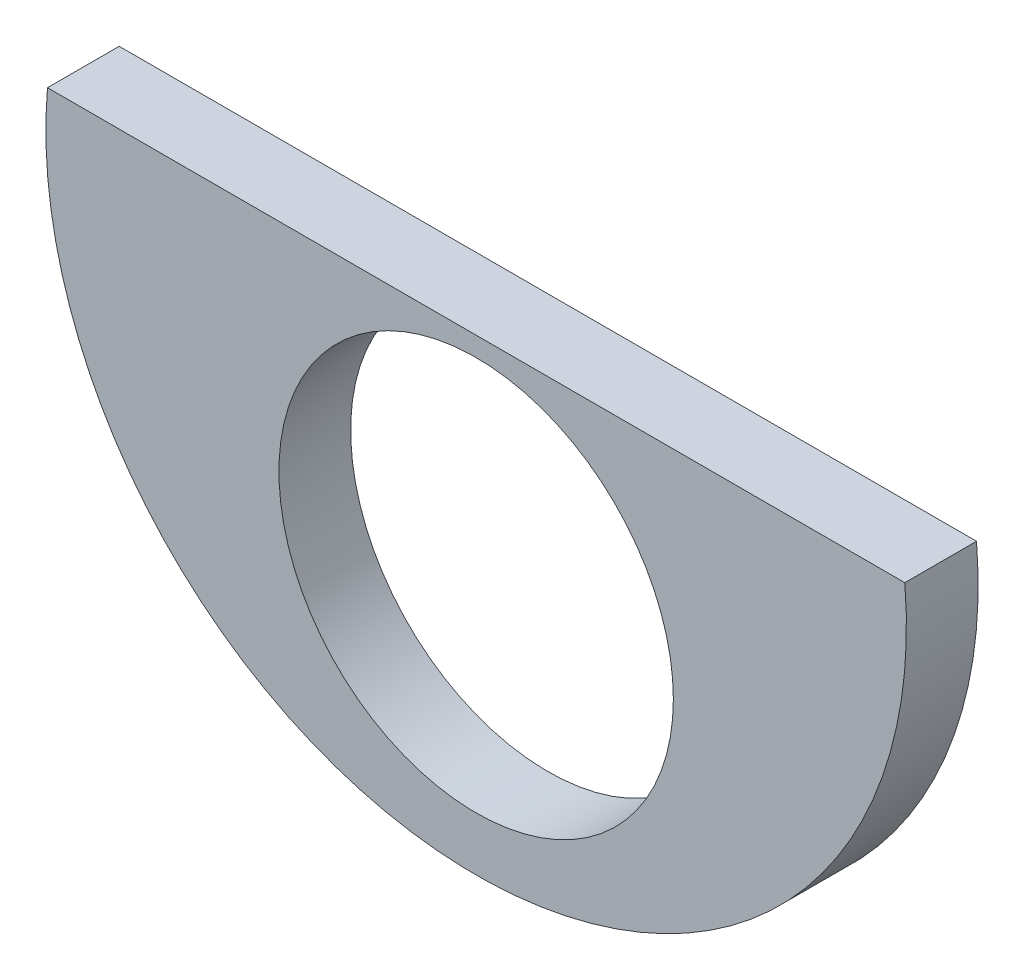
ISO-10303-21;
HEADER;
FILE_DESCRIPTION(('STEP AP214'),'2;1');
FILE_NAME('part.step','',(''),(''),'','','');
FILE_SCHEMA(('AUTOMOTIVE_DESIGN { 1 0 10303 214 1 1 1 1 }'));
ENDSEC;
DATA;
#1=APPLICATION_CONTEXT('core data for automotive mechanical design processes');
#2=APPLICATION_PROTOCOL_DEFINITION('international standard','automotive_design',2000,#1);
#3=PRODUCT_CONTEXT('',#1,'mechanical');
#4=PRODUCT('Part','Part','',(#3));
#5=PRODUCT_RELATED_PRODUCT_CATEGORY('part','',(#4));
#6=PRODUCT_DEFINITION_FORMATION('','',#4);
#7=PRODUCT_DEFINITION_CONTEXT('part definition',#1,'design');
#8=PRODUCT_DEFINITION('design','',#6,#7);
#9=PRODUCT_DEFINITION_SHAPE('','',#8);
#10=(LENGTH_UNIT() NAMED_UNIT(*) SI_UNIT(.MILLI.,.METRE.));
#11=(NAMED_UNIT(*) PLANE_ANGLE_UNIT() SI_UNIT($,.RADIAN.));
#12=(NAMED_UNIT(*) SI_UNIT($,.STERADIAN.) SOLID_ANGLE_UNIT());
#13=UNCERTAINTY_MEASURE_WITH_UNIT(LENGTH_MEASURE(1.E-05),#10,'distance_accuracy_value','');
#14=(GEOMETRIC_REPRESENTATION_CONTEXT(3) GLOBAL_UNCERTAINTY_ASSIGNED_CONTEXT((#13)) GLOBAL_UNIT_ASSIGNED_CONTEXT((#10,
#11,#12)) REPRESENTATION_CONTEXT('',''));
#15=CARTESIAN_POINT('',(0.,0.,0.));
#16=DIRECTION('',(0.,0.,1.));
#17=DIRECTION('',(1.,0.,0.));
#18=AXIS2_PLACEMENT_3D('',#15,#16,#17);
#19=CARTESIAN_POINT('',(0.,0.,3.175));
#20=DIRECTION('',(0.,0.,-1.));
#21=DIRECTION('',(-1.,0.,0.));
#22=AXIS2_PLACEMENT_3D('',#19,#20,#21);
#23=CYLINDRICAL_SURFACE('',#22,19.05);
#24=CARTESIAN_POINT('',(0.,0.,0.));
#25=DIRECTION('',(0.,0.,1.));
#26=DIRECTION('',(-1.,0.,0.));
#27=AXIS2_PLACEMENT_3D('',#24,#25,#26);
#28=CIRCLE('',#27,19.05);
#29=CARTESIAN_POINT('',(-18.9783218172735,1.651,0.));
#30=VERTEX_POINT('',#29);
#31=CARTESIAN_POINT('',(18.9783218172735,1.651,0.));
#32=VERTEX_POINT('',#31);
#33=EDGE_CURVE('E58',#30,#32,#28,.T.);
#34=ORIENTED_EDGE('',*,*,#33,.T.);
#35=DIRECTION('',(0.,0.,-1.));
#36=VECTOR('',#35,1.);
#37=CARTESIAN_POINT('',(18.9783218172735,1.651,3.175));
#38=LINE('',#37,#36);
#39=CARTESIAN_POINT('',(18.9783218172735,1.651,3.175));
#40=VERTEX_POINT('',#39);
#41=EDGE_CURVE('E11',#40,#32,#38,.T.);
#42=ORIENTED_EDGE('',*,*,#41,.F.);
#43=CARTESIAN_POINT('',(0.,0.,3.175));
#44=DIRECTION('',(0.,0.,1.));
#45=DIRECTION('',(-1.,0.,0.));
#46=AXIS2_PLACEMENT_3D('',#43,#44,#45);
#47=CIRCLE('',#46,19.05);
#48=CARTESIAN_POINT('',(-18.9783218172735,1.651,3.175));
#49=VERTEX_POINT('',#48);
#50=EDGE_CURVE('E60',#49,#40,#47,.T.);
#51=ORIENTED_EDGE('',*,*,#50,.F.);
#52=DIRECTION('',(0.,0.,-1.));
#53=VECTOR('',#52,1.);
#54=CARTESIAN_POINT('',(-18.9783218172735,1.651,3.175));
#55=LINE('',#54,#53);
#56=EDGE_CURVE('E38',#49,#30,#55,.T.);
#57=ORIENTED_EDGE('',*,*,#56,.T.);
#58=EDGE_LOOP('',(#34,#42,#51,#57));
#59=FACE_BOUND('',#58,.T.);
#60=ADVANCED_FACE('F31',(#59),#23,.T.);
#61=CARTESIAN_POINT('',(-18.9783218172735,1.651,3.175));
#62=DIRECTION('',(0.,-1.,0.));
#63=DIRECTION('',(0.,0.,-1.));
#64=AXIS2_PLACEMENT_3D('',#61,#62,#63);
#65=PLANE('',#64);
#66=DIRECTION('',(-1.,0.,0.));
#67=VECTOR('',#66,1.);
#68=CARTESIAN_POINT('',(-18.9783218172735,1.651,0.));
#69=LINE('',#68,#67);
#70=EDGE_CURVE('E55',#32,#30,#69,.T.);
#71=ORIENTED_EDGE('',*,*,#70,.T.);
#72=ORIENTED_EDGE('',*,*,#56,.F.);
#73=DIRECTION('',(-1.,0.,0.));
#74=VECTOR('',#73,1.);
#75=CARTESIAN_POINT('',(-18.9783218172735,1.651,3.175));
#76=LINE('',#75,#74);
#77=EDGE_CURVE('E44',#40,#49,#76,.T.);
#78=ORIENTED_EDGE('',*,*,#77,.F.);
#79=ORIENTED_EDGE('',*,*,#41,.T.);
#80=EDGE_LOOP('',(#71,#72,#78,#79));
#81=FACE_BOUND('',#80,.T.);
#82=ADVANCED_FACE('F63',(#81),#65,.F.);
#83=CARTESIAN_POINT('',(0.,0.,3.175));
#84=DIRECTION('',(0.,0.,-1.));
#85=DIRECTION('',(-1.,0.,0.));
#86=AXIS2_PLACEMENT_3D('',#83,#84,#85);
#87=PLANE('',#86);
#88=CARTESIAN_POINT('',(0.,-7.9375,3.175));
#89=DIRECTION('',(0.,0.,1.));
#90=DIRECTION('',(1.,0.,0.));
#91=AXIS2_PLACEMENT_3D('',#88,#89,#90);
#92=CIRCLE('',#91,8.73125);
#93=CARTESIAN_POINT('',(8.73125,-7.9375,3.175));
#94=VERTEX_POINT('',#93);
#95=EDGE_CURVE('E69',#94,#94,#92,.T.);
#96=ORIENTED_EDGE('',*,*,#95,.F.);
#97=EDGE_LOOP('',(#96));
#98=FACE_BOUND('',#97,.T.);
#99=ORIENTED_EDGE('',*,*,#50,.T.);
#100=ORIENTED_EDGE('',*,*,#77,.T.);
#101=EDGE_LOOP('',(#99,#100));
#102=FACE_BOUND('',#101,.T.);
#103=ADVANCED_FACE('F74',(#98,#102),#87,.F.);
#104=CARTESIAN_POINT('',(0.,0.,0.));
#105=DIRECTION('',(0.,0.,-1.));
#106=DIRECTION('',(-1.,0.,0.));
#107=AXIS2_PLACEMENT_3D('',#104,#105,#106);
#108=PLANE('',#107);
#109=CARTESIAN_POINT('',(0.,-7.9375,0.));
#110=DIRECTION('',(0.,0.,1.));
#111=DIRECTION('',(1.,0.,0.));
#112=AXIS2_PLACEMENT_3D('',#109,#110,#111);
#113=CIRCLE('',#112,8.73125);
#114=CARTESIAN_POINT('',(8.73125,-7.9375,0.));
#115=VERTEX_POINT('',#114);
#116=EDGE_CURVE('E66',#115,#115,#113,.T.);
#117=ORIENTED_EDGE('',*,*,#116,.T.);
#118=EDGE_LOOP('',(#117));
#119=FACE_BOUND('',#118,.T.);
#120=ORIENTED_EDGE('',*,*,#33,.F.);
#121=ORIENTED_EDGE('',*,*,#70,.F.);
#122=EDGE_LOOP('',(#120,#121));
#123=FACE_BOUND('',#122,.T.);
#124=ADVANCED_FACE('F56',(#119,#123),#108,.T.);
#125=CARTESIAN_POINT('',(0.,-7.9375,0.));
#126=DIRECTION('',(0.,0.,1.));
#127=DIRECTION('',(1.,0.,0.));
#128=AXIS2_PLACEMENT_3D('',#125,#126,#127);
#129=CYLINDRICAL_SURFACE('',#128,8.73125);
#130=ORIENTED_EDGE('',*,*,#116,.F.);
#131=EDGE_LOOP('',(#130));
#132=FACE_BOUND('',#131,.T.);
#133=ORIENTED_EDGE('',*,*,#95,.T.);
#134=EDGE_LOOP('',(#133));
#135=FACE_BOUND('',#134,.T.);
#136=ADVANCED_FACE('F82',(#132,#135),#129,.F.);
#137=CLOSED_SHELL('',(#60,#82,#103,#124,#136));
#138=MANIFOLD_SOLID_BREP('B2',#137);
#139=ADVANCED_BREP_SHAPE_REPRESENTATION('',(#18,#138),#14);
#140=SHAPE_DEFINITION_REPRESENTATION(#9,#139);
ENDSEC;
END-ISO-10303-21;
